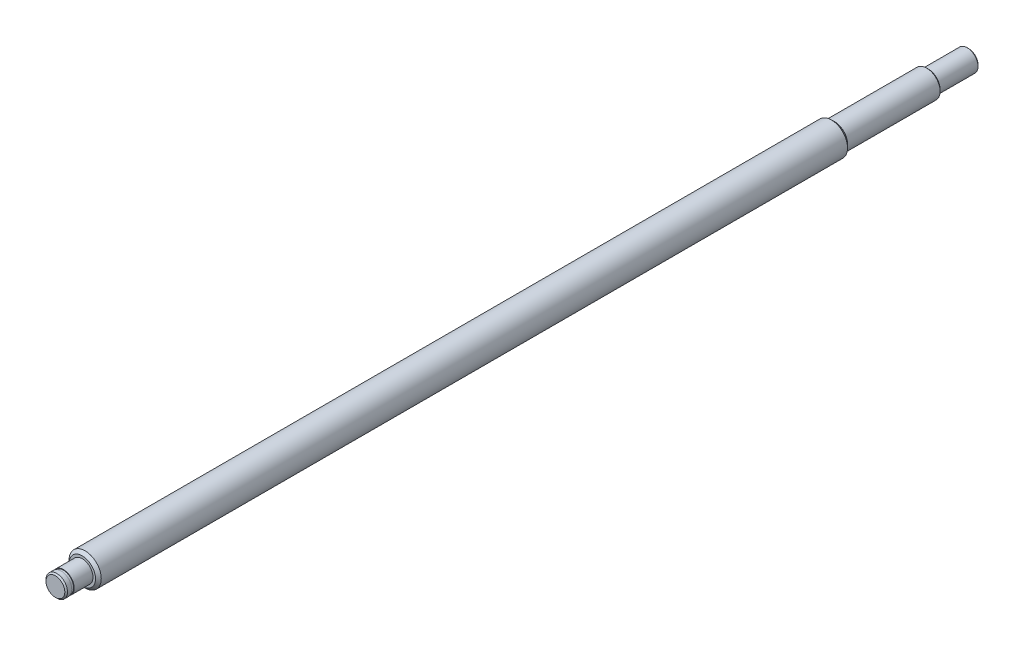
ISO-10303-21;
HEADER;
FILE_DESCRIPTION(('STEP AP214'),'2;1');
FILE_NAME('part.step','',(''),(''),'','','');
FILE_SCHEMA(('AUTOMOTIVE_DESIGN { 1 0 10303 214 1 1 1 1 }'));
ENDSEC;
DATA;
#1=APPLICATION_CONTEXT('core data for automotive mechanical design processes');
#2=APPLICATION_PROTOCOL_DEFINITION('international standard','automotive_design',2000,#1);
#3=PRODUCT_CONTEXT('',#1,'mechanical');
#4=PRODUCT('Part','Part','',(#3));
#5=PRODUCT_RELATED_PRODUCT_CATEGORY('part','',(#4));
#6=PRODUCT_DEFINITION_FORMATION('','',#4);
#7=PRODUCT_DEFINITION_CONTEXT('part definition',#1,'design');
#8=PRODUCT_DEFINITION('design','',#6,#7);
#9=PRODUCT_DEFINITION_SHAPE('','',#8);
#10=(LENGTH_UNIT() NAMED_UNIT(*) SI_UNIT(.MILLI.,.METRE.));
#11=(NAMED_UNIT(*) PLANE_ANGLE_UNIT() SI_UNIT($,.RADIAN.));
#12=(NAMED_UNIT(*) SI_UNIT($,.STERADIAN.) SOLID_ANGLE_UNIT());
#13=UNCERTAINTY_MEASURE_WITH_UNIT(LENGTH_MEASURE(1.E-05),#10,'distance_accuracy_value','');
#14=(GEOMETRIC_REPRESENTATION_CONTEXT(3) GLOBAL_UNCERTAINTY_ASSIGNED_CONTEXT((#13)) GLOBAL_UNIT_ASSIGNED_CONTEXT((#10,
#11,#12)) REPRESENTATION_CONTEXT('',''));
#15=CARTESIAN_POINT('',(0.,0.,0.));
#16=DIRECTION('',(0.,0.,1.));
#17=DIRECTION('',(1.,0.,0.));
#18=AXIS2_PLACEMENT_3D('',#15,#16,#17);
#19=CARTESIAN_POINT('',(0.,0.,0.));
#20=DIRECTION('',(0.,0.,-1.));
#21=DIRECTION('',(-1.,0.,0.));
#22=AXIS2_PLACEMENT_3D('',#19,#20,#21);
#23=PLANE('',#22);
#24=CARTESIAN_POINT('',(0.,0.,-1.13686729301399E-10));
#25=DIRECTION('',(0.,0.,-1.));
#26=DIRECTION('',(-1.,0.,0.));
#27=AXIS2_PLACEMENT_3D('',#24,#25,#26);
#28=CIRCLE('',#27,3.49999999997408);
#29=CARTESIAN_POINT('',(-3.49999999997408,0.,-1.13686729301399E-10));
#30=VERTEX_POINT('',#29);
#31=EDGE_CURVE('E17',#30,#30,#28,.T.);
#32=ORIENTED_EDGE('',*,*,#31,.F.);
#33=EDGE_LOOP('',(#32));
#34=FACE_BOUND('',#33,.T.);
#35=ADVANCED_FACE('F14',(#34),#23,.F.);
#36=CARTESIAN_POINT('',(0.,3.5,-340.));
#37=DIRECTION('',(0.,0.,1.));
#38=DIRECTION('',(1.,0.,0.));
#39=AXIS2_PLACEMENT_3D('',#36,#37,#38);
#40=PLANE('',#39);
#41=CARTESIAN_POINT('',(0.,0.,-339.999999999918));
#42=DIRECTION('',(0.,0.,1.));
#43=DIRECTION('',(1.,0.,0.));
#44=AXIS2_PLACEMENT_3D('',#41,#42,#43);
#45=CIRCLE('',#44,3.49999999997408);
#46=CARTESIAN_POINT('',(3.49999999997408,0.,-339.999999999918));
#47=VERTEX_POINT('',#46);
#48=EDGE_CURVE('E49',#47,#47,#45,.T.);
#49=ORIENTED_EDGE('',*,*,#48,.F.);
#50=EDGE_LOOP('',(#49));
#51=FACE_BOUND('',#50,.T.);
#52=ADVANCED_FACE('F87',(#51),#40,.F.);
#53=CARTESIAN_POINT('',(0.,0.,-0.499999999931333));
#54=DIRECTION('',(0.,0.,-1.));
#55=DIRECTION('',(-1.,0.,0.));
#56=AXIS2_PLACEMENT_3D('',#53,#54,#55);
#57=CONICAL_SURFACE('',#56,3.99999999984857,0.785398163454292);
#58=ORIENTED_EDGE('',*,*,#31,.T.);
#59=EDGE_LOOP('',(#58));
#60=FACE_BOUND('',#59,.T.);
#61=CARTESIAN_POINT('',(0.,0.,-0.5));
#62=DIRECTION('',(0.,0.,1.));
#63=DIRECTION('',(1.,0.,0.));
#64=AXIS2_PLACEMENT_3D('',#61,#62,#63);
#65=CIRCLE('',#64,4.);
#66=CARTESIAN_POINT('',(4.,0.,-0.5));
#67=VERTEX_POINT('',#66);
#68=EDGE_CURVE('E44',#67,#67,#65,.F.);
#69=ORIENTED_EDGE('',*,*,#68,.F.);
#70=EDGE_LOOP('',(#69));
#71=FACE_BOUND('',#70,.T.);
#72=ADVANCED_FACE('F83',(#60,#71),#57,.T.);
#73=CARTESIAN_POINT('',(0.,0.,-339.49999999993));
#74=DIRECTION('',(0.,0.,1.));
#75=DIRECTION('',(1.,0.,0.));
#76=AXIS2_PLACEMENT_3D('',#73,#74,#75);
#77=CONICAL_SURFACE('',#76,4.0000000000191,0.785398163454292);
#78=CARTESIAN_POINT('',(0.,0.,-339.5));
#79=DIRECTION('',(0.,0.,1.));
#80=DIRECTION('',(1.,0.,0.));
#81=AXIS2_PLACEMENT_3D('',#78,#79,#80);
#82=CIRCLE('',#81,4.);
#83=CARTESIAN_POINT('',(4.,0.,-339.5));
#84=VERTEX_POINT('',#83);
#85=EDGE_CURVE('E40',#84,#84,#82,.T.);
#86=ORIENTED_EDGE('',*,*,#85,.F.);
#87=EDGE_LOOP('',(#86));
#88=FACE_BOUND('',#87,.T.);
#89=ORIENTED_EDGE('',*,*,#48,.T.);
#90=EDGE_LOOP('',(#89));
#91=FACE_BOUND('',#90,.T.);
#92=ADVANCED_FACE('F153',(#88,#91),#77,.T.);
#93=CARTESIAN_POINT('',(0.,0.,-340.));
#94=DIRECTION('',(0.,0.,1.));
#95=DIRECTION('',(1.,0.,0.));
#96=AXIS2_PLACEMENT_3D('',#93,#94,#95);
#97=CYLINDRICAL_SURFACE('',#96,4.);
#98=ORIENTED_EDGE('',*,*,#68,.T.);
#99=EDGE_LOOP('',(#98));
#100=FACE_BOUND('',#99,.T.);
#101=CARTESIAN_POINT('',(0.,0.,-2.1));
#102=DIRECTION('',(0.,0.,1.));
#103=DIRECTION('',(1.,0.,0.));
#104=AXIS2_PLACEMENT_3D('',#101,#102,#103);
#105=CIRCLE('',#104,4.);
#106=CARTESIAN_POINT('',(4.,0.,-2.1));
#107=VERTEX_POINT('',#106);
#108=EDGE_CURVE('E43',#107,#107,#105,.T.);
#109=ORIENTED_EDGE('',*,*,#108,.T.);
#110=EDGE_LOOP('',(#109));
#111=FACE_BOUND('',#110,.T.);
#112=ADVANCED_FACE('F149',(#100,#111),#97,.T.);
#113=CARTESIAN_POINT('',(0.,0.,-340.));
#114=DIRECTION('',(0.,0.,1.));
#115=DIRECTION('',(1.,0.,0.));
#116=AXIS2_PLACEMENT_3D('',#113,#114,#115);
#117=CYLINDRICAL_SURFACE('',#116,4.);
#118=CARTESIAN_POINT('',(0.,0.,-325.));
#119=DIRECTION('',(0.,0.,1.));
#120=DIRECTION('',(1.,0.,0.));
#121=AXIS2_PLACEMENT_3D('',#118,#119,#120);
#122=CIRCLE('',#121,4.);
#123=CARTESIAN_POINT('',(4.,0.,-325.));
#124=VERTEX_POINT('',#123);
#125=EDGE_CURVE('E73',#124,#124,#122,.F.);
#126=ORIENTED_EDGE('',*,*,#125,.T.);
#127=EDGE_LOOP('',(#126));
#128=FACE_BOUND('',#127,.T.);
#129=ORIENTED_EDGE('',*,*,#85,.T.);
#130=EDGE_LOOP('',(#129));
#131=FACE_BOUND('',#130,.T.);
#132=ADVANCED_FACE('F145',(#128,#131),#117,.T.);
#133=CARTESIAN_POINT('',(0.,4.,-2.1));
#134=DIRECTION('',(0.,0.,1.));
#135=DIRECTION('',(1.,0.,0.));
#136=AXIS2_PLACEMENT_3D('',#133,#134,#135);
#137=PLANE('',#136);
#138=ORIENTED_EDGE('',*,*,#108,.F.);
#139=EDGE_LOOP('',(#138));
#140=FACE_BOUND('',#139,.T.);
#141=CARTESIAN_POINT('',(0.,0.,-2.1));
#142=DIRECTION('',(0.,0.,1.));
#143=DIRECTION('',(1.,0.,0.));
#144=AXIS2_PLACEMENT_3D('',#141,#142,#143);
#145=CIRCLE('',#144,3.8);
#146=CARTESIAN_POINT('',(3.8,0.,-2.1));
#147=VERTEX_POINT('',#146);
#148=EDGE_CURVE('E70',#147,#147,#145,.F.);
#149=ORIENTED_EDGE('',*,*,#148,.F.);
#150=EDGE_LOOP('',(#149));
#151=FACE_BOUND('',#150,.T.);
#152=ADVANCED_FACE('F141',(#140,#151),#137,.F.);
#153=CARTESIAN_POINT('',(0.,4.3865,-325.));
#154=DIRECTION('',(0.,0.,1.));
#155=DIRECTION('',(1.,0.,0.));
#156=AXIS2_PLACEMENT_3D('',#153,#154,#155);
#157=PLANE('',#156);
#158=CARTESIAN_POINT('',(0.,0.,-325.000000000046));
#159=DIRECTION('',(0.,0.,1.));
#160=DIRECTION('',(1.,0.,0.));
#161=AXIS2_PLACEMENT_3D('',#158,#159,#160);
#162=CIRCLE('',#161,4.38650000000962);
#163=CARTESIAN_POINT('',(4.38650000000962,0.,-325.000000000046));
#164=VERTEX_POINT('',#163);
#165=EDGE_CURVE('E67',#164,#164,#162,.T.);
#166=ORIENTED_EDGE('',*,*,#165,.F.);
#167=EDGE_LOOP('',(#166));
#168=FACE_BOUND('',#167,.T.);
#169=ORIENTED_EDGE('',*,*,#125,.F.);
#170=EDGE_LOOP('',(#169));
#171=FACE_BOUND('',#170,.T.);
#172=ADVANCED_FACE('F137',(#168,#171),#157,.F.);
#173=CARTESIAN_POINT('',(0.,0.,-340.));
#174=DIRECTION('',(0.,0.,1.));
#175=DIRECTION('',(1.,0.,0.));
#176=AXIS2_PLACEMENT_3D('',#173,#174,#175);
#177=CYLINDRICAL_SURFACE('',#176,3.8);
#178=ORIENTED_EDGE('',*,*,#148,.T.);
#179=EDGE_LOOP('',(#178));
#180=FACE_BOUND('',#179,.T.);
#181=CARTESIAN_POINT('',(0.,0.,-3.));
#182=DIRECTION('',(0.,0.,1.));
#183=DIRECTION('',(1.,0.,0.));
#184=AXIS2_PLACEMENT_3D('',#181,#182,#183);
#185=CIRCLE('',#184,3.8);
#186=CARTESIAN_POINT('',(3.8,0.,-3.));
#187=VERTEX_POINT('',#186);
#188=EDGE_CURVE('E37',#187,#187,#185,.T.);
#189=ORIENTED_EDGE('',*,*,#188,.T.);
#190=EDGE_LOOP('',(#189));
#191=FACE_BOUND('',#190,.T.);
#192=ADVANCED_FACE('F133',(#180,#191),#177,.T.);
#193=CARTESIAN_POINT('',(0.,0.,-324.3865));
#194=DIRECTION('',(0.,0.,1.));
#195=DIRECTION('',(1.,0.,0.));
#196=AXIS2_PLACEMENT_3D('',#193,#194,#195);
#197=CONICAL_SURFACE('',#196,5.0000000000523,0.785398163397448);
#198=CARTESIAN_POINT('',(0.,0.,-324.3865));
#199=DIRECTION('',(0.,0.,1.));
#200=DIRECTION('',(1.,0.,0.));
#201=AXIS2_PLACEMENT_3D('',#198,#199,#200);
#202=CIRCLE('',#201,5.);
#203=CARTESIAN_POINT('',(5.,0.,-324.3865));
#204=VERTEX_POINT('',#203);
#205=EDGE_CURVE('E33',#204,#204,#202,.T.);
#206=ORIENTED_EDGE('',*,*,#205,.F.);
#207=EDGE_LOOP('',(#206));
#208=FACE_BOUND('',#207,.T.);
#209=ORIENTED_EDGE('',*,*,#165,.T.);
#210=EDGE_LOOP('',(#209));
#211=FACE_BOUND('',#210,.T.);
#212=ADVANCED_FACE('F129',(#208,#211),#197,.T.);
#213=CARTESIAN_POINT('',(0.,3.8,-3.));
#214=DIRECTION('',(0.,0.,-1.));
#215=DIRECTION('',(-1.,0.,0.));
#216=AXIS2_PLACEMENT_3D('',#213,#214,#215);
#217=PLANE('',#216);
#218=ORIENTED_EDGE('',*,*,#188,.F.);
#219=EDGE_LOOP('',(#218));
#220=FACE_BOUND('',#219,.T.);
#221=CARTESIAN_POINT('',(0.,0.,-3.));
#222=DIRECTION('',(0.,0.,1.));
#223=DIRECTION('',(1.,0.,0.));
#224=AXIS2_PLACEMENT_3D('',#221,#222,#223);
#225=CIRCLE('',#224,4.);
#226=CARTESIAN_POINT('',(4.,0.,-3.));
#227=VERTEX_POINT('',#226);
#228=EDGE_CURVE('E36',#227,#227,#225,.F.);
#229=ORIENTED_EDGE('',*,*,#228,.F.);
#230=EDGE_LOOP('',(#229));
#231=FACE_BOUND('',#230,.T.);
#232=ADVANCED_FACE('F125',(#220,#231),#217,.F.);
#233=CARTESIAN_POINT('',(0.,0.,-340.));
#234=DIRECTION('',(0.,0.,1.));
#235=DIRECTION('',(1.,0.,0.));
#236=AXIS2_PLACEMENT_3D('',#233,#234,#235);
#237=CYLINDRICAL_SURFACE('',#236,5.);
#238=CARTESIAN_POINT('',(0.,0.,-290.));
#239=DIRECTION('',(0.,0.,1.));
#240=DIRECTION('',(1.,0.,0.));
#241=AXIS2_PLACEMENT_3D('',#238,#239,#240);
#242=CIRCLE('',#241,5.);
#243=CARTESIAN_POINT('',(5.,0.,-290.));
#244=VERTEX_POINT('',#243);
#245=EDGE_CURVE('E60',#244,#244,#242,.F.);
#246=ORIENTED_EDGE('',*,*,#245,.T.);
#247=EDGE_LOOP('',(#246));
#248=FACE_BOUND('',#247,.T.);
#249=ORIENTED_EDGE('',*,*,#205,.T.);
#250=EDGE_LOOP('',(#249));
#251=FACE_BOUND('',#250,.T.);
#252=ADVANCED_FACE('F121',(#248,#251),#237,.T.);
#253=CARTESIAN_POINT('',(0.,0.,-340.));
#254=DIRECTION('',(0.,0.,1.));
#255=DIRECTION('',(1.,0.,0.));
#256=AXIS2_PLACEMENT_3D('',#253,#254,#255);
#257=CYLINDRICAL_SURFACE('',#256,4.);
#258=ORIENTED_EDGE('',*,*,#228,.T.);
#259=EDGE_LOOP('',(#258));
#260=FACE_BOUND('',#259,.T.);
#261=CARTESIAN_POINT('',(0.,0.,-10.));
#262=DIRECTION('',(0.,0.,1.));
#263=DIRECTION('',(1.,0.,0.));
#264=AXIS2_PLACEMENT_3D('',#261,#262,#263);
#265=CIRCLE('',#264,4.);
#266=CARTESIAN_POINT('',(4.,0.,-10.));
#267=VERTEX_POINT('',#266);
#268=EDGE_CURVE('E57',#267,#267,#265,.T.);
#269=ORIENTED_EDGE('',*,*,#268,.T.);
#270=EDGE_LOOP('',(#269));
#271=FACE_BOUND('',#270,.T.);
#272=ADVANCED_FACE('F117',(#260,#271),#257,.T.);
#273=CARTESIAN_POINT('',(0.,4.9265,-290.));
#274=DIRECTION('',(0.,0.,-1.));
#275=DIRECTION('',(-1.,0.,0.));
#276=AXIS2_PLACEMENT_3D('',#273,#274,#275);
#277=PLANE('',#276);
#278=CARTESIAN_POINT('',(0.,0.,-290.00000000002));
#279=DIRECTION('',(0.,0.,1.));
#280=DIRECTION('',(1.,0.,0.));
#281=AXIS2_PLACEMENT_3D('',#278,#279,#280);
#282=CIRCLE('',#281,4.92649999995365);
#283=CARTESIAN_POINT('',(4.92649999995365,0.,-290.00000000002));
#284=VERTEX_POINT('',#283);
#285=EDGE_CURVE('E54',#284,#284,#282,.T.);
#286=ORIENTED_EDGE('',*,*,#285,.F.);
#287=EDGE_LOOP('',(#286));
#288=FACE_BOUND('',#287,.T.);
#289=ORIENTED_EDGE('',*,*,#245,.F.);
#290=EDGE_LOOP('',(#289));
#291=FACE_BOUND('',#290,.T.);
#292=ADVANCED_FACE('F113',(#288,#291),#277,.F.);
#293=CARTESIAN_POINT('',(0.,4.,-10.));
#294=DIRECTION('',(0.,0.,-1.));
#295=DIRECTION('',(-1.,0.,0.));
#296=AXIS2_PLACEMENT_3D('',#293,#294,#295);
#297=PLANE('',#296);
#298=ORIENTED_EDGE('',*,*,#268,.F.);
#299=EDGE_LOOP('',(#298));
#300=FACE_BOUND('',#299,.T.);
#301=CARTESIAN_POINT('',(0.,0.,-9.99999999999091));
#302=DIRECTION('',(0.,0.,-1.));
#303=DIRECTION('',(-1.,0.,0.));
#304=AXIS2_PLACEMENT_3D('',#301,#302,#303);
#305=CIRCLE('',#304,4.92650000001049);
#306=CARTESIAN_POINT('',(-4.92650000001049,0.,-9.99999999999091));
#307=VERTEX_POINT('',#306);
#308=EDGE_CURVE('E26',#307,#307,#305,.T.);
#309=ORIENTED_EDGE('',*,*,#308,.F.);
#310=EDGE_LOOP('',(#309));
#311=FACE_BOUND('',#310,.T.);
#312=ADVANCED_FACE('F109',(#300,#311),#297,.F.);
#313=CARTESIAN_POINT('',(0.,0.,-288.926500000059));
#314=DIRECTION('',(0.,0.,1.));
#315=DIRECTION('',(1.,0.,0.));
#316=AXIS2_PLACEMENT_3D('',#313,#314,#315);
#317=CONICAL_SURFACE('',#316,5.99999999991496,0.785398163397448);
#318=CARTESIAN_POINT('',(0.,0.,-288.9265));
#319=DIRECTION('',(0.,0.,1.));
#320=DIRECTION('',(1.,0.,0.));
#321=AXIS2_PLACEMENT_3D('',#318,#319,#320);
#322=CIRCLE('',#321,6.);
#323=CARTESIAN_POINT('',(6.,0.,-288.9265));
#324=VERTEX_POINT('',#323);
#325=EDGE_CURVE('E21',#324,#324,#322,.T.);
#326=ORIENTED_EDGE('',*,*,#325,.F.);
#327=EDGE_LOOP('',(#326));
#328=FACE_BOUND('',#327,.T.);
#329=ORIENTED_EDGE('',*,*,#285,.T.);
#330=EDGE_LOOP('',(#329));
#331=FACE_BOUND('',#330,.T.);
#332=ADVANCED_FACE('F102',(#328,#331),#317,.T.);
#333=CARTESIAN_POINT('',(0.,0.,-11.0735000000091));
#334=DIRECTION('',(0.,0.,-1.));
#335=DIRECTION('',(-1.,0.,0.));
#336=AXIS2_PLACEMENT_3D('',#333,#334,#335);
#337=CONICAL_SURFACE('',#336,6.00000000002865,0.785398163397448);
#338=ORIENTED_EDGE('',*,*,#308,.T.);
#339=EDGE_LOOP('',(#338));
#340=FACE_BOUND('',#339,.T.);
#341=CARTESIAN_POINT('',(0.,0.,-11.0735));
#342=DIRECTION('',(0.,0.,1.));
#343=DIRECTION('',(1.,0.,0.));
#344=AXIS2_PLACEMENT_3D('',#341,#342,#343);
#345=CIRCLE('',#344,6.);
#346=CARTESIAN_POINT('',(6.,0.,-11.0735));
#347=VERTEX_POINT('',#346);
#348=EDGE_CURVE('E10',#347,#347,#345,.F.);
#349=ORIENTED_EDGE('',*,*,#348,.F.);
#350=EDGE_LOOP('',(#349));
#351=FACE_BOUND('',#350,.T.);
#352=ADVANCED_FACE('F96',(#340,#351),#337,.T.);
#353=CARTESIAN_POINT('',(0.,0.,-340.));
#354=DIRECTION('',(0.,0.,1.));
#355=DIRECTION('',(1.,0.,0.));
#356=AXIS2_PLACEMENT_3D('',#353,#354,#355);
#357=CYLINDRICAL_SURFACE('',#356,6.);
#358=ORIENTED_EDGE('',*,*,#348,.T.);
#359=EDGE_LOOP('',(#358));
#360=FACE_BOUND('',#359,.T.);
#361=ORIENTED_EDGE('',*,*,#325,.T.);
#362=EDGE_LOOP('',(#361));
#363=FACE_BOUND('',#362,.T.);
#364=ADVANCED_FACE('F94',(#360,#363),#357,.T.);
#365=CLOSED_SHELL('',(#35,#52,#72,#92,#112,#132,#152,#172,#192,#212,#232,#252,#272,#292,#312,
#332,#352,#364));
#366=MANIFOLD_SOLID_BREP('B1',#365);
#367=ADVANCED_BREP_SHAPE_REPRESENTATION('',(#18,#366),#14);
#368=SHAPE_DEFINITION_REPRESENTATION(#9,#367);
ENDSEC;
END-ISO-10303-21;
